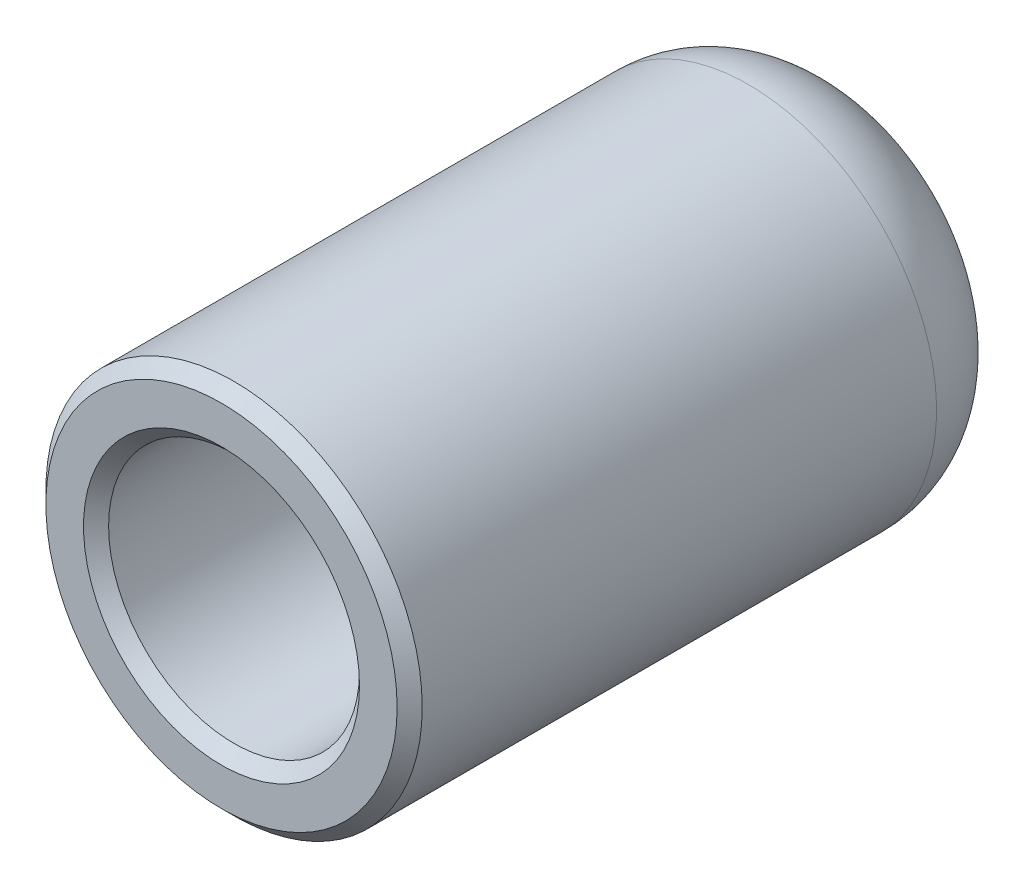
ISO-10303-21;
HEADER;
FILE_DESCRIPTION(('STEP AP214'),'2;1');
FILE_NAME('part.step','',(''),(''),'','','');
FILE_SCHEMA(('AUTOMOTIVE_DESIGN { 1 0 10303 214 1 1 1 1 }'));
ENDSEC;
DATA;
#1=APPLICATION_CONTEXT('core data for automotive mechanical design processes');
#2=APPLICATION_PROTOCOL_DEFINITION('international standard','automotive_design',2000,#1);
#3=PRODUCT_CONTEXT('',#1,'mechanical');
#4=PRODUCT('Part','Part','',(#3));
#5=PRODUCT_RELATED_PRODUCT_CATEGORY('part','',(#4));
#6=PRODUCT_DEFINITION_FORMATION('','',#4);
#7=PRODUCT_DEFINITION_CONTEXT('part definition',#1,'design');
#8=PRODUCT_DEFINITION('design','',#6,#7);
#9=PRODUCT_DEFINITION_SHAPE('','',#8);
#10=(LENGTH_UNIT() NAMED_UNIT(*) SI_UNIT(.MILLI.,.METRE.));
#11=(NAMED_UNIT(*) PLANE_ANGLE_UNIT() SI_UNIT($,.RADIAN.));
#12=(NAMED_UNIT(*) SI_UNIT($,.STERADIAN.) SOLID_ANGLE_UNIT());
#13=UNCERTAINTY_MEASURE_WITH_UNIT(LENGTH_MEASURE(1.E-05),#10,'distance_accuracy_value','');
#14=(GEOMETRIC_REPRESENTATION_CONTEXT(3) GLOBAL_UNCERTAINTY_ASSIGNED_CONTEXT((#13)) GLOBAL_UNIT_ASSIGNED_CONTEXT((#10,
#11,#12)) REPRESENTATION_CONTEXT('',''));
#15=CARTESIAN_POINT('',(0.,0.,0.));
#16=DIRECTION('',(0.,0.,1.));
#17=DIRECTION('',(1.,0.,0.));
#18=AXIS2_PLACEMENT_3D('',#15,#16,#17);
#19=CARTESIAN_POINT('',(0.,0.,25.));
#20=DIRECTION('',(0.,0.,-1.));
#21=DIRECTION('',(-1.,0.,0.));
#22=AXIS2_PLACEMENT_3D('',#19,#20,#21);
#23=CYLINDRICAL_SURFACE('',#22,2.5);
#24=CARTESIAN_POINT('',(0.,0.,13.));
#25=DIRECTION('',(0.,0.,1.));
#26=DIRECTION('',(1.,0.,0.));
#27=AXIS2_PLACEMENT_3D('',#24,#25,#26);
#28=CIRCLE('',#27,2.5);
#29=CARTESIAN_POINT('',(2.5,0.,13.));
#30=VERTEX_POINT('',#29);
#31=EDGE_CURVE('E263',#30,#30,#28,.F.);
#32=ORIENTED_EDGE('',*,*,#31,.F.);
#33=EDGE_LOOP('',(#32));
#34=FACE_BOUND('',#33,.T.);
#35=CARTESIAN_POINT('',(0.,0.,10.));
#36=DIRECTION('',(0.,0.,-1.));
#37=DIRECTION('',(-1.,0.,0.));
#38=AXIS2_PLACEMENT_3D('',#35,#36,#37);
#39=CIRCLE('',#38,2.5);
#40=CARTESIAN_POINT('',(-2.5,0.,10.));
#41=VERTEX_POINT('',#40);
#42=EDGE_CURVE('E38',#41,#41,#39,.F.);
#43=ORIENTED_EDGE('',*,*,#42,.F.);
#44=EDGE_LOOP('',(#43));
#45=FACE_BOUND('',#44,.T.);
#46=ADVANCED_FACE('F33',(#34,#45),#23,.F.);
#47=CARTESIAN_POINT('',(0.,0.,25.));
#48=DIRECTION('',(0.,0.,-1.));
#49=DIRECTION('',(-1.,0.,0.));
#50=AXIS2_PLACEMENT_3D('',#47,#48,#49);
#51=CYLINDRICAL_SURFACE('',#50,7.5);
#52=CARTESIAN_POINT('',(0.,0.,4.));
#53=DIRECTION('',(0.,0.,1.));
#54=DIRECTION('',(1.,0.,0.));
#55=AXIS2_PLACEMENT_3D('',#52,#53,#54);
#56=CIRCLE('',#55,7.5);
#57=CARTESIAN_POINT('',(2.09601180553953,-7.20116202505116,4.));
#58=VERTEX_POINT('',#57);
#59=CARTESIAN_POINT('',(-2.09601180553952,-7.20116202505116,4.));
#60=VERTEX_POINT('',#59);
#61=EDGE_CURVE('E243',#58,#60,#56,.T.);
#62=ORIENTED_EDGE('',*,*,#61,.T.);
#63=CARTESIAN_POINT('',(0.,0.,-3.22916358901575));
#64=DIRECTION('',(0.,0.708477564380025,0.705733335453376));
#65=DIRECTION('',(0.,0.705733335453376,-0.708477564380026));
#66=AXIS2_PLACEMENT_3D('',#63,#64,#65);
#67=ELLIPSE('',#66,10.627243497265,7.5);
#68=EDGE_CURVE('E58',#60,#58,#67,.T.);
#69=ORIENTED_EDGE('',*,*,#68,.T.);
#70=EDGE_LOOP('',(#62,#69));
#71=FACE_BOUND('',#70,.T.);
#72=CARTESIAN_POINT('',(0.,0.,24.5));
#73=DIRECTION('',(0.,0.,1.));
#74=DIRECTION('',(1.,0.,0.));
#75=AXIS2_PLACEMENT_3D('',#72,#73,#74);
#76=CIRCLE('',#75,7.5);
#77=CARTESIAN_POINT('',(7.5,0.,24.5));
#78=VERTEX_POINT('',#77);
#79=EDGE_CURVE('E277',#78,#78,#76,.F.);
#80=ORIENTED_EDGE('',*,*,#79,.T.);
#81=EDGE_LOOP('',(#80));
#82=FACE_BOUND('',#81,.T.);
#83=ADVANCED_FACE('F258',(#71,#82),#51,.T.);
#84=CARTESIAN_POINT('',(0.,0.,25.));
#85=DIRECTION('',(0.,0.,1.));
#86=DIRECTION('',(1.,0.,0.));
#87=AXIS2_PLACEMENT_3D('',#84,#85,#86);
#88=PLANE('',#87);
#89=CARTESIAN_POINT('',(0.,0.,25.));
#90=DIRECTION('',(0.,0.,1.));
#91=DIRECTION('',(1.,0.,0.));
#92=AXIS2_PLACEMENT_3D('',#89,#90,#91);
#93=CIRCLE('',#92,5.50000000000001);
#94=CARTESIAN_POINT('',(5.50000000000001,0.,25.));
#95=VERTEX_POINT('',#94);
#96=EDGE_CURVE('E275',#95,#95,#93,.F.);
#97=ORIENTED_EDGE('',*,*,#96,.T.);
#98=EDGE_LOOP('',(#97));
#99=FACE_BOUND('',#98,.T.);
#100=CARTESIAN_POINT('',(0.,0.,25.));
#101=DIRECTION('',(0.,0.,1.));
#102=DIRECTION('',(1.,0.,0.));
#103=AXIS2_PLACEMENT_3D('',#100,#101,#102);
#104=CIRCLE('',#103,7.00000000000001);
#105=CARTESIAN_POINT('',(7.00000000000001,0.,25.));
#106=VERTEX_POINT('',#105);
#107=EDGE_CURVE('E272',#106,#106,#104,.T.);
#108=ORIENTED_EDGE('',*,*,#107,.T.);
#109=EDGE_LOOP('',(#108));
#110=FACE_BOUND('',#109,.T.);
#111=ADVANCED_FACE('F287',(#99,#110),#88,.T.);
#112=CARTESIAN_POINT('',(0.,0.,13.));
#113=DIRECTION('',(0.,0.,1.));
#114=DIRECTION('',(1.,0.,0.));
#115=AXIS2_PLACEMENT_3D('',#112,#113,#114);
#116=PLANE('',#115);
#117=CARTESIAN_POINT('',(0.,0.,13.));
#118=DIRECTION('',(0.,0.,1.));
#119=DIRECTION('',(1.,0.,0.));
#120=AXIS2_PLACEMENT_3D('',#117,#118,#119);
#121=CIRCLE('',#120,5.);
#122=CARTESIAN_POINT('',(5.,0.,13.));
#123=VERTEX_POINT('',#122);
#124=EDGE_CURVE('E260',#123,#123,#121,.T.);
#125=ORIENTED_EDGE('',*,*,#124,.T.);
#126=EDGE_LOOP('',(#125));
#127=FACE_BOUND('',#126,.T.);
#128=ORIENTED_EDGE('',*,*,#31,.T.);
#129=EDGE_LOOP('',(#128));
#130=FACE_BOUND('',#129,.T.);
#131=ADVANCED_FACE('F232',(#127,#130),#116,.T.);
#132=CARTESIAN_POINT('',(0.,0.,13.));
#133=DIRECTION('',(0.,0.,1.));
#134=DIRECTION('',(1.,0.,0.));
#135=AXIS2_PLACEMENT_3D('',#132,#133,#134);
#136=CYLINDRICAL_SURFACE('',#135,5.);
#137=CARTESIAN_POINT('',(0.,0.,24.5));
#138=DIRECTION('',(0.,0.,1.));
#139=DIRECTION('',(1.,0.,0.));
#140=AXIS2_PLACEMENT_3D('',#137,#138,#139);
#141=CIRCLE('',#140,5.);
#142=CARTESIAN_POINT('',(5.,0.,24.5));
#143=VERTEX_POINT('',#142);
#144=EDGE_CURVE('E269',#143,#143,#141,.T.);
#145=ORIENTED_EDGE('',*,*,#144,.T.);
#146=EDGE_LOOP('',(#145));
#147=FACE_BOUND('',#146,.T.);
#148=ORIENTED_EDGE('',*,*,#124,.F.);
#149=EDGE_LOOP('',(#148));
#150=FACE_BOUND('',#149,.T.);
#151=ADVANCED_FACE('F295',(#147,#150),#136,.F.);
#152=CARTESIAN_POINT('',(0.,0.,24.5));
#153=DIRECTION('',(0.,0.,1.));
#154=DIRECTION('',(1.,0.,0.));
#155=AXIS2_PLACEMENT_3D('',#152,#153,#154);
#156=CONICAL_SURFACE('',#155,5.,0.785398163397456);
#157=ORIENTED_EDGE('',*,*,#96,.F.);
#158=EDGE_LOOP('',(#157));
#159=FACE_BOUND('',#158,.T.);
#160=ORIENTED_EDGE('',*,*,#144,.F.);
#161=EDGE_LOOP('',(#160));
#162=FACE_BOUND('',#161,.T.);
#163=ADVANCED_FACE('F284',(#159,#162),#156,.F.);
#164=CARTESIAN_POINT('',(0.,0.,25.));
#165=DIRECTION('',(0.,0.,-1.));
#166=DIRECTION('',(-1.,0.,0.));
#167=AXIS2_PLACEMENT_3D('',#164,#165,#166);
#168=CONICAL_SURFACE('',#167,7.00000000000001,0.785398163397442);
#169=ORIENTED_EDGE('',*,*,#79,.F.);
#170=EDGE_LOOP('',(#169));
#171=FACE_BOUND('',#170,.T.);
#172=ORIENTED_EDGE('',*,*,#107,.F.);
#173=EDGE_LOOP('',(#172));
#174=FACE_BOUND('',#173,.T.);
#175=ADVANCED_FACE('F281',(#171,#174),#168,.T.);
#176=CARTESIAN_POINT('',(0.,0.,4.));
#177=DIRECTION('',(0.,0.,1.));
#178=DIRECTION('',(1.,0.,0.));
#179=AXIS2_PLACEMENT_3D('',#176,#177,#178);
#180=DEGENERATE_TOROIDAL_SURFACE('',#179,3.5,4.,.T.);
#181=CARTESIAN_POINT('',(-1.44954746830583,-3.5002,0.0104162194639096));
#182=CARTESIAN_POINT('',(-1.5349754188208,-3.41477204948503,0.00710153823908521));
#183=CARTESIAN_POINT('',(-1.620416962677,-3.32933050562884,0.00489692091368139));
#184=CARTESIAN_POINT('',(-1.79130751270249,-3.15843995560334,0.00191822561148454));
#185=CARTESIAN_POINT('',(-1.87675651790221,-3.07299095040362,0.00114404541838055));
#186=CARTESIAN_POINT('',(-2.04764924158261,-2.90209822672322,0.000236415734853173));
#187=CARTESIAN_POINT('',(-2.13309296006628,-2.81665450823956,0.00010292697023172));
#188=CARTESIAN_POINT('',(-2.303982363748,-2.64576510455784,-1.52824222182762E-05));
#189=CARTESIAN_POINT('',(-2.38942804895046,-2.56031941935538,0.));
#190=CARTESIAN_POINT('',(-2.56031941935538,-2.38942804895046,0.));
#191=CARTESIAN_POINT('',(-2.64576510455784,-2.303982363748,-1.52824222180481E-05));
#192=CARTESIAN_POINT('',(-2.81665450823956,-2.13309296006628,0.00010292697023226));
#193=CARTESIAN_POINT('',(-2.90209822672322,-2.04764924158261,0.000236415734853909));
#194=CARTESIAN_POINT('',(-3.07299095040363,-1.87675651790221,0.00114404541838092));
#195=CARTESIAN_POINT('',(-3.15843995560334,-1.79130751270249,0.00191822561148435));
#196=CARTESIAN_POINT('',(-3.32933050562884,-1.620416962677,0.00489692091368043));
#197=CARTESIAN_POINT('',(-3.41477204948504,-1.5349754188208,0.00710153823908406));
#198=CARTESIAN_POINT('',(-3.5002,-1.44954746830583,0.010416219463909));
#199=B_SPLINE_CURVE_WITH_KNOTS('',3,(#181,#182,#183,#184,#185,#186,#187,#188,#189,#190,#191,
#192,#193,#194,#195,#196,#197,#198),.UNSPECIFIED.,.F.,.F.,(4,2,2,2,2,2,2,2,4),(0.,
0.362555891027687,0.725085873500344,1.08759363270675,1.45010882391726,1.81262401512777,
2.17513177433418,2.53766175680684,2.90021764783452),.UNSPECIFIED.);
#200=CARTESIAN_POINT('',(-1.73009726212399,-3.21965020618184,0.00300615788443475));
#201=VERTEX_POINT('',#200);
#202=CARTESIAN_POINT('',(-3.5,-1.44974746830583,0.0104083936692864));
#203=VERTEX_POINT('',#202);
#204=EDGE_CURVE('E178',#201,#203,#199,.T.);
#205=ORIENTED_EDGE('',*,*,#204,.F.);
#206=CARTESIAN_POINT('',(-2.09532719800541,-7.2013612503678,4.0002));
#207=CARTESIAN_POINT('',(-2.33374103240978,-7.1320466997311,3.93061592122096));
#208=CARTESIAN_POINT('',(-2.56540797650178,-7.04983970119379,3.84808926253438));
#209=CARTESIAN_POINT('',(-3.00844611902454,-6.8596147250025,3.65712460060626));
#210=CARTESIAN_POINT('',(-3.21966814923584,-6.75142456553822,3.54851374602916));
#211=CARTESIAN_POINT('',(-3.57826279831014,-6.53065223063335,3.3268829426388));
#212=CARTESIAN_POINT('',(-3.73038700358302,-6.42193558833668,3.21774355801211));
#213=CARTESIAN_POINT('',(-4.00723791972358,-6.18861272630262,2.98351342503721));
#214=CARTESIAN_POINT('',(-4.13204015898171,-6.06405185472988,2.858468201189));
#215=CARTESIAN_POINT('',(-4.32705586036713,-5.82605391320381,2.61954480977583));
#216=CARTESIAN_POINT('',(-4.40313869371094,-5.71501456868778,2.50807369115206));
#217=CARTESIAN_POINT('',(-4.52873078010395,-5.48560760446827,2.27777468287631));
#218=CARTESIAN_POINT('',(-4.57825916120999,-5.36724532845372,2.15895215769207));
#219=CARTESIAN_POINT('',(-4.64030372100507,-5.14700748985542,1.93785792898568));
#220=CARTESIAN_POINT('',(-4.65774393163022,-5.04582620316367,1.83628320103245));
#221=CARTESIAN_POINT('',(-4.66883366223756,-4.84274270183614,1.63241001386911));
#222=CARTESIAN_POINT('',(-4.66248956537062,-4.74084068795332,1.53011175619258));
#223=CARTESIAN_POINT('',(-4.62377575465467,-4.53862752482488,1.32711229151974));
#224=CARTESIAN_POINT('',(-4.59120434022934,-4.43833487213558,1.22642965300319));
#225=CARTESIAN_POINT('',(-4.49879209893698,-4.24421152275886,1.0315514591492));
#226=CARTESIAN_POINT('',(-4.43898133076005,-4.15037383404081,0.937348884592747));
#227=CARTESIAN_POINT('',(-4.30318369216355,-3.9855113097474,0.771845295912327));
#228=CARTESIAN_POINT('',(-4.23051201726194,-3.91312030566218,0.699172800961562));
#229=CARTESIAN_POINT('',(-4.06792521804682,-3.77877355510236,0.564303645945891));
#230=CARTESIAN_POINT('',(-3.97801749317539,-3.7168133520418,0.502102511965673));
#231=CARTESIAN_POINT('',(-3.79023110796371,-3.6081990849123,0.393065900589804));
#232=CARTESIAN_POINT('',(-3.69314799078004,-3.56085239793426,0.345535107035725));
#233=CARTESIAN_POINT('',(-3.49010908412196,-3.47694683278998,0.261303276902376));
#234=CARTESIAN_POINT('',(-3.38415230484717,-3.44038916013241,0.22460345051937));
#235=CARTESIAN_POINT('',(-3.18851676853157,-3.38373088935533,0.16772486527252));
#236=CARTESIAN_POINT('',(-3.09987418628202,-3.36179760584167,0.145706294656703));
#237=CARTESIAN_POINT('',(-2.92012875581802,-3.32364289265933,0.107403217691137));
#238=CARTESIAN_POINT('',(-2.82902441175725,-3.30742502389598,0.0911222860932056));
#239=CARTESIAN_POINT('',(-2.55309076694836,-3.2660481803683,0.0495845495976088));
#240=CARTESIAN_POINT('',(-2.36606010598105,-3.24827711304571,0.0317443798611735));
#241=CARTESIAN_POINT('',(-2.07608527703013,-3.23051967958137,0.0139178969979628));
#242=CARTESIAN_POINT('',(-1.97349543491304,-3.22612235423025,0.00950347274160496));
#243=CARTESIAN_POINT('',(-1.76813182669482,-3.21999406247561,0.00335135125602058));
#244=CARTESIAN_POINT('',(-1.6653580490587,-3.21826326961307,0.00161382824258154));
#245=CARTESIAN_POINT('',(-1.4599734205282,-3.2165172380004,-0.000138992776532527));
#246=CARTESIAN_POINT('',(-1.35736258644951,-3.21649911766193,-0.000157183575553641));
#247=CARTESIAN_POINT('',(-1.15215237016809,-3.21736289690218,0.00070995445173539));
#248=CARTESIAN_POINT('',(-1.04955298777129,-3.21824477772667,0.00159526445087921));
#249=CARTESIAN_POINT('',(-0.844323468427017,-3.22025856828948,0.00361688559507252));
#250=CARTESIAN_POINT('',(-0.741693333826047,-3.22139056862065,0.0047532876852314));
#251=CARTESIAN_POINT('',(-0.536428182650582,-3.22342302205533,0.00679364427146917));
#252=CARTESIAN_POINT('',(-0.433793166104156,-3.22432347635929,0.00769759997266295));
#253=CARTESIAN_POINT('',(-0.228521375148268,-3.22559254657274,0.00897160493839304));
#254=CARTESIAN_POINT('',(-0.125884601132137,-3.2259611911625,0.00934168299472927));
#255=CARTESIAN_POINT('',(0.07938900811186,-3.22605585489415,0.00943671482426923));
#256=CARTESIAN_POINT('',(0.182025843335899,-3.22578187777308,0.00916167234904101));
#257=CARTESIAN_POINT('',(0.387447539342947,-3.22467229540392,0.00804777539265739));
#258=CARTESIAN_POINT('',(0.490232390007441,-3.22383584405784,0.00720807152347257));
#259=CARTESIAN_POINT('',(0.695798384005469,-3.22187382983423,0.00523842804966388));
#260=CARTESIAN_POINT('',(0.798579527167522,-3.22074825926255,0.00410848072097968));
#261=CARTESIAN_POINT('',(1.00414375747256,-3.2186651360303,0.00201725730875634));
#262=CARTESIAN_POINT('',(1.10692684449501,-3.21770757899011,0.00105597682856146));
#263=CARTESIAN_POINT('',(1.31249937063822,-3.21659006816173,-6.58794166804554E-05));
#264=CARTESIAN_POINT('',(1.41528880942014,-3.21643008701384,-0.000226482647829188));
#265=CARTESIAN_POINT('',(1.61983658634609,-3.2176913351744,0.00103966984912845));
#266=CARTESIAN_POINT('',(1.72159494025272,-3.21909674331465,0.0024505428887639));
#267=CARTESIAN_POINT('',(1.92497436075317,-3.22437080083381,0.0077451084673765));
#268=CARTESIAN_POINT('',(2.02659541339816,-3.22823968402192,0.0116290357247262));
#269=CARTESIAN_POINT('',(2.33060078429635,-3.24505754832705,0.0285122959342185));
#270=CARTESIAN_POINT('',(2.53263618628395,-3.2632109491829,0.0467362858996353));
#271=CARTESIAN_POINT('',(2.87856282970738,-3.31468927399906,0.0984147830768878));
#272=CARTESIAN_POINT('',(3.02392026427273,-3.34284574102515,0.12668073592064));
#273=CARTESIAN_POINT('',(3.30667491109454,-3.41502863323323,0.199144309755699));
#274=CARTESIAN_POINT('',(3.44408161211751,-3.45903566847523,0.243322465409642));
#275=CARTESIAN_POINT('',(3.67991800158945,-3.55461096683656,0.339269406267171));
#276=CARTESIAN_POINT('',(3.780792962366,-3.60315398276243,0.388001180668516));
#277=CARTESIAN_POINT('',(3.96956627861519,-3.71153791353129,0.496806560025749));
#278=CARTESIAN_POINT('',(4.05747036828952,-3.77137380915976,0.556875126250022));
#279=CARTESIAN_POINT('',(4.21729648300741,-3.90113017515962,0.687136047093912));
#280=CARTESIAN_POINT('',(4.28918084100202,-3.97107378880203,0.757351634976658));
#281=CARTESIAN_POINT('',(4.41459460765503,-4.11873349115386,0.905585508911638));
#282=CARTESIAN_POINT('',(4.46811837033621,-4.19645196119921,0.983606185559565));
#283=CARTESIAN_POINT('',(4.55456824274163,-4.35453969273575,1.14230863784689));
#284=CARTESIAN_POINT('',(4.58808958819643,-4.43474854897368,1.22282938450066));
#285=CARTESIAN_POINT('',(4.63736461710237,-4.59780556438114,1.38652044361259));
#286=CARTESIAN_POINT('',(4.65311568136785,-4.68065411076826,1.46969114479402));
#287=CARTESIAN_POINT('',(4.66842528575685,-4.85499898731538,1.64471395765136));
#288=CARTESIAN_POINT('',(4.66629722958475,-4.94656686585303,1.73663789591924));
#289=CARTESIAN_POINT('',(4.6434415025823,-5.12851480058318,1.91929333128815));
#290=CARTESIAN_POINT('',(4.6227044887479,-5.21889423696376,2.01002420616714));
#291=CARTESIAN_POINT('',(4.55978347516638,-5.41125078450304,2.20312872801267));
#292=CARTESIAN_POINT('',(4.5146827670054,-5.51275089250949,2.30502351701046));
#293=CARTESIAN_POINT('',(4.40482382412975,-5.71027131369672,2.50331199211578));
#294=CARTESIAN_POINT('',(4.34005486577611,-5.80628860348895,2.59970264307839));
#295=CARTESIAN_POINT('',(4.17972353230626,-6.009183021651,2.80338601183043));
#296=CARTESIAN_POINT('',(4.08065376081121,-6.11467857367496,2.90929178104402));
#297=CARTESIAN_POINT('',(3.86271649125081,-6.31492028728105,3.11031213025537));
#298=CARTESIAN_POINT('',(3.74383463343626,-6.40965856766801,3.20541879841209));
#299=CARTESIAN_POINT('',(3.46492373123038,-6.6051083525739,3.40162858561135));
#300=CARTESIAN_POINT('',(3.3014001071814,-6.70333247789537,3.50023465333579));
#301=CARTESIAN_POINT('',(2.9565159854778,-6.88259828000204,3.68019752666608));
#302=CARTESIAN_POINT('',(2.77515499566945,-6.96363948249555,3.76155385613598));
#303=CARTESIAN_POINT('',(2.50735864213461,-7.06668970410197,3.86500478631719));
#304=CARTESIAN_POINT('',(2.42629015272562,-7.0958519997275,3.8942804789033));
#305=CARTESIAN_POINT('',(2.26222985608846,-7.15097532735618,3.94961815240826));
#306=CARTESIAN_POINT('',(2.17924303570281,-7.17694374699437,3.97568754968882));
#307=CARTESIAN_POINT('',(2.09532719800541,-7.20136125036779,4.0002));
#308=B_SPLINE_CURVE_WITH_KNOTS('',3,(#206,#207,#208,#209,#210,#211,#212,#213,#214,#215,#216,
#217,#218,#219,#220,#221,#222,#223,#224,#225,#226,#227,#228,#229,#230,#231,#232,#233,#234,#235,
#236,#237,#238,#239,#240,#241,#242,#243,#244,#245,#246,#247,#248,#249,#250,#251,#252,#253,#254,
#255,#256,#257,#258,#259,#260,#261,#262,#263,#264,#265,#266,#267,#268,#269,#270,#271,#272,#273,
#274,#275,#276,#277,#278,#279,#280,#281,#282,#283,#284,#285,#286,#287,#288,#289,#290,#291,#292,
#293,#294,#295,#296,#297,#298,#299,#300,#301,#302,#303,#304,#305,#306,#307),.UNSPECIFIED.,.F.,
.F.,(4,2,2,2,2,2,2,2,2,2,2,2,2,2,2,2,2,2,2,2,2,2,2,2,2,2,2,2,2,2,2,2,2,2,2,2,2,2,2,2,2,2,2,2,2,
2,2,2,2,2,4),(0.,0.77400296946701,1.5532838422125,2.20023475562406,2.84537401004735,
3.36767703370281,3.88960331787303,4.32115082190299,4.75258251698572,5.18736418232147,
5.62166722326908,5.99678483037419,6.37174175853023,6.72432901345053,7.07695564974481,
7.35834007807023,7.6398995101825,8.20434600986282,8.51266828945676,8.82101063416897,
9.12883418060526,9.43665131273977,9.74458011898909,10.0525073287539,10.3604179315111,
10.6683267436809,10.9766997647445,11.285080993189,11.5934541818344,11.9018167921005,
12.2070908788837,12.5123939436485,13.121476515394,13.5722795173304,14.0225329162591,
14.3872389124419,14.7517831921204,15.1171757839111,15.4826806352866,15.8366822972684,
16.1907361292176,16.5785385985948,16.9665358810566,17.4170340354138,17.8677782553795,
18.4037884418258,18.9401888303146,19.5820443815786,20.2239176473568,20.4967893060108,
20.7690174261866),.UNSPECIFIED.);
#309=EDGE_CURVE('E242',#60,#201,#308,.T.);
#310=ORIENTED_EDGE('',*,*,#309,.F.);
#311=ORIENTED_EDGE('',*,*,#61,.F.);
#312=CARTESIAN_POINT('',(1.73009726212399,-3.21965020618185,0.00300615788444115));
#313=VERTEX_POINT('',#312);
#314=EDGE_CURVE('E235',#313,#58,#308,.T.);
#315=ORIENTED_EDGE('',*,*,#314,.F.);
#316=CARTESIAN_POINT('',(3.5002,-1.44954746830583,0.0104162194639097));
#317=CARTESIAN_POINT('',(3.41477204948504,-1.5349754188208,0.00710153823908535));
#318=CARTESIAN_POINT('',(3.32933050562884,-1.620416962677,0.00489692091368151));
#319=CARTESIAN_POINT('',(3.15843995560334,-1.79130751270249,0.00191822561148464));
#320=CARTESIAN_POINT('',(3.07299095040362,-1.87675651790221,0.00114404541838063));
#321=CARTESIAN_POINT('',(2.90209822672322,-2.04764924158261,0.000236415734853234));
#322=CARTESIAN_POINT('',(2.81665450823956,-2.13309296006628,0.000102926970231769));
#323=CARTESIAN_POINT('',(2.64576510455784,-2.303982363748,-1.52824222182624E-05));
#324=CARTESIAN_POINT('',(2.56031941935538,-2.38942804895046,0.));
#325=CARTESIAN_POINT('',(2.38942804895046,-2.56031941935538,0.));
#326=CARTESIAN_POINT('',(2.303982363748,-2.64576510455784,-1.52824222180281E-05));
#327=CARTESIAN_POINT('',(2.13309296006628,-2.81665450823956,0.000102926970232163));
#328=CARTESIAN_POINT('',(2.04764924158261,-2.90209822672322,0.000236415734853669));
#329=CARTESIAN_POINT('',(1.87675651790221,-3.07299095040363,0.00114404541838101));
#330=CARTESIAN_POINT('',(1.79130751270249,-3.15843995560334,0.00191822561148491));
#331=CARTESIAN_POINT('',(1.620416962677,-3.32933050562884,0.00489692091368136));
#332=CARTESIAN_POINT('',(1.5349754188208,-3.41477204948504,0.00710153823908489));
#333=CARTESIAN_POINT('',(1.44954746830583,-3.5002,0.0104162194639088));
#334=B_SPLINE_CURVE_WITH_KNOTS('',3,(#316,#317,#318,#319,#320,#321,#322,#323,#324,#325,#326,
#327,#328,#329,#330,#331,#332,#333),.UNSPECIFIED.,.F.,.F.,(4,2,2,2,2,2,2,2,4),(0.,
0.362555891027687,0.725085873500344,1.08759363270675,1.45010882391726,1.81262401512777,
2.17513177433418,2.53766175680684,2.90021764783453),.UNSPECIFIED.);
#335=CARTESIAN_POINT('',(3.5,-1.44974746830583,0.0104083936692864));
#336=VERTEX_POINT('',#335);
#337=EDGE_CURVE('E50',#336,#313,#334,.T.);
#338=ORIENTED_EDGE('',*,*,#337,.F.);
#339=CARTESIAN_POINT('',(3.5,6.39029876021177,2.70920935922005));
#340=CARTESIAN_POINT('',(3.5,6.35128127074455,2.60879098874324));
#341=CARTESIAN_POINT('',(3.5,6.30775177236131,2.5101453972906));
#342=CARTESIAN_POINT('',(3.5,6.212194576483,2.31710830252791));
#343=CARTESIAN_POINT('',(3.5,6.16017041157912,2.22271505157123));
#344=CARTESIAN_POINT('',(3.5,6.04821939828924,2.03897564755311));
#345=CARTESIAN_POINT('',(3.5,5.98830724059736,1.94962054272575));
#346=CARTESIAN_POINT('',(3.5,5.86111738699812,1.77634318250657));
#347=CARTESIAN_POINT('',(3.5,5.79383921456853,1.69242127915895));
#348=CARTESIAN_POINT('',(3.5,5.58216856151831,1.44988062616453));
#349=CARTESIAN_POINT('',(3.5,5.42761758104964,1.2999633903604));
#350=CARTESIAN_POINT('',(3.5,5.09717346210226,1.02644213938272));
#351=CARTESIAN_POINT('',(3.5,4.92129753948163,0.902817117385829));
#352=CARTESIAN_POINT('',(3.5,4.6391863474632,0.733703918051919));
#353=CARTESIAN_POINT('',(3.5,4.53856366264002,0.678599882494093));
#354=CARTESIAN_POINT('',(3.5,4.33347291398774,0.575939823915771));
#355=CARTESIAN_POINT('',(3.5,4.22900326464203,0.52838695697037));
#356=CARTESIAN_POINT('',(3.5,4.01683490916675,0.440587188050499));
#357=CARTESIAN_POINT('',(3.5,3.90913074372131,0.400353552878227));
#358=CARTESIAN_POINT('',(3.5,3.69150252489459,0.326990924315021));
#359=CARTESIAN_POINT('',(3.5,3.58158141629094,0.293853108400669));
#360=CARTESIAN_POINT('',(3.5,3.25245817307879,0.205219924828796));
#361=CARTESIAN_POINT('',(3.5,3.03065862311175,0.159209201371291));
#362=CARTESIAN_POINT('',(3.5,2.69556139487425,0.10581578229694));
#363=CARTESIAN_POINT('',(3.5,2.58336702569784,0.0906155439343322));
#364=CARTESIAN_POINT('',(3.5,2.35846454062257,0.064682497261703));
#365=CARTESIAN_POINT('',(3.5,2.2457564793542,0.0539492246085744));
#366=CARTESIAN_POINT('',(3.5,1.90570927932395,0.0271577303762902));
#367=CARTESIAN_POINT('',(3.5,1.67794316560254,0.0167247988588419));
#368=CARTESIAN_POINT('',(3.5,1.33615937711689,0.0072642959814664));
#369=CARTESIAN_POINT('',(3.5,1.22218095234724,0.00514251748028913));
#370=CARTESIAN_POINT('',(3.5,0.994206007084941,0.0021926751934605));
#371=CARTESIAN_POINT('',(3.5,0.880209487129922,0.00136457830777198));
#372=CARTESIAN_POINT('',(3.5,0.650927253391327,0.000347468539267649));
#373=CARTESIAN_POINT('',(3.5,0.535641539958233,0.000165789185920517));
#374=CARTESIAN_POINT('',(3.5,0.305094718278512,-7.60906238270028E-06));
#375=CARTESIAN_POINT('',(3.5,0.189833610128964,6.30772271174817E-07));
#376=CARTESIAN_POINT('',(3.5,-0.0407231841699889,-4.73191175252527E-07));
#377=CARTESIAN_POINT('',(3.5,-0.156018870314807,-9.82226738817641E-06));
#378=CARTESIAN_POINT('',(3.5,-0.386609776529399,3.73857210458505E-05));
#379=CARTESIAN_POINT('',(3.5,-0.501904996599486,9.39427296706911E-05));
#380=CARTESIAN_POINT('',(3.5,-0.732045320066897,0.000634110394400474));
#381=CARTESIAN_POINT('',(3.5,-0.84689041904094,0.00111604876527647));
#382=CARTESIAN_POINT('',(3.5,-1.07657085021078,0.00309240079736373));
#383=CARTESIAN_POINT('',(3.5,-1.19140618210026,0.00458683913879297));
#384=CARTESIAN_POINT('',(3.5,-1.53579308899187,0.0116941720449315));
#385=CARTESIAN_POINT('',(3.5,-1.765329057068,0.019930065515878));
#386=CARTESIAN_POINT('',(3.5,-2.1344492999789,0.0442911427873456));
#387=CARTESIAN_POINT('',(3.5,-2.27430288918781,0.0561030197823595));
#388=CARTESIAN_POINT('',(3.5,-2.55335093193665,0.0864122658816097));
#389=CARTESIAN_POINT('',(3.5,-2.69254517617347,0.104911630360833));
#390=CARTESIAN_POINT('',(3.5,-2.9687503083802,0.149843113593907));
#391=CARTESIAN_POINT('',(3.5,-3.10576949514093,0.176223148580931));
#392=CARTESIAN_POINT('',(3.5,-3.37775293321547,0.238140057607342));
#393=CARTESIAN_POINT('',(3.5,-3.51271716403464,0.273677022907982));
#394=CARTESIAN_POINT('',(3.5,-3.78160787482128,0.355473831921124));
#395=CARTESIAN_POINT('',(3.5,-3.91548821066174,0.401886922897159));
#396=CARTESIAN_POINT('',(3.5,-4.17888360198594,0.505862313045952));
#397=CARTESIAN_POINT('',(3.5,-4.30839853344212,0.563424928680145));
#398=CARTESIAN_POINT('',(3.5,-4.56198338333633,0.690286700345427));
#399=CARTESIAN_POINT('',(3.5,-4.68603874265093,0.759615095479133));
#400=CARTESIAN_POINT('',(3.5,-4.92681246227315,0.910014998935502));
#401=CARTESIAN_POINT('',(3.5,-5.04353292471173,0.991083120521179));
#402=CARTESIAN_POINT('',(3.5,-5.24216881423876,1.14470754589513));
#403=CARTESIAN_POINT('',(3.5,-5.32590559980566,1.21491893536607));
#404=CARTESIAN_POINT('',(3.5,-5.48738020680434,1.36192256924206));
#405=CARTESIAN_POINT('',(3.5,-5.56511911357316,1.43871361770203));
#406=CARTESIAN_POINT('',(3.5,-5.71371119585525,1.59834278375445));
#407=CARTESIAN_POINT('',(3.5,-5.78458100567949,1.68116539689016));
#408=CARTESIAN_POINT('',(3.5,-5.9189592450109,1.85254352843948));
#409=CARTESIAN_POINT('',(3.5,-5.98246981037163,1.94109737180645));
#410=CARTESIAN_POINT('',(3.5,-6.11145741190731,2.13864427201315));
#411=CARTESIAN_POINT('',(3.5,-6.1754952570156,2.24858273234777));
#412=CARTESIAN_POINT('',(3.5,-6.29189912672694,2.47458888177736));
#413=CARTESIAN_POINT('',(3.5,-6.34425505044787,2.59066176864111));
#414=CARTESIAN_POINT('',(3.5,-6.39029876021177,2.70920935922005));
#415=B_SPLINE_CURVE_WITH_KNOTS('',3,(#339,#340,#341,#342,#343,#344,#345,#346,#347,#348,#349,
#350,#351,#352,#353,#354,#355,#356,#357,#358,#359,#360,#361,#362,#363,#364,#365,#366,#367,#368,
#369,#370,#371,#372,#373,#374,#375,#376,#377,#378,#379,#380,#381,#382,#383,#384,#385,#386,#387,
#388,#389,#390,#391,#392,#393,#394,#395,#396,#397,#398,#399,#400,#401,#402,#403,#404,#405,#406,
#407,#408,#409,#410,#411,#412,#413,#414),.UNSPECIFIED.,.F.,.F.,(4,2,2,2,2,2,2,2,2,2,2,2,2,2,2,2,
2,2,2,2,2,2,2,2,2,2,2,2,2,2,2,2,2,2,2,2,2,4),(0.,0.323060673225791,0.645987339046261,
0.968320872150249,1.29067526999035,1.93356296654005,2.57593506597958,2.91983192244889,
3.26387213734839,3.60852987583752,3.95275656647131,4.63081826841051,4.97042246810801,
5.30999135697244,5.99365334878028,6.33565267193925,6.67764324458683,7.02350150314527,
7.36928460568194,7.71517148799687,8.061058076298,8.40559092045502,8.75013216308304,
9.43890421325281,9.85983503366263,10.2808915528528,10.6992246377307,11.1175618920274,
11.5421915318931,11.9668332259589,12.3925460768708,12.8181363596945,13.1456322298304,
13.4730686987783,13.7996913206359,14.1262189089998,14.50721456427,14.8885383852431),.UNSPECIFIED.);
#416=CARTESIAN_POINT('',(3.5,1.44974746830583,0.0104083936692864));
#417=VERTEX_POINT('',#416);
#418=EDGE_CURVE('E201',#417,#336,#415,.T.);
#419=ORIENTED_EDGE('',*,*,#418,.F.);
#420=CARTESIAN_POINT('',(1.44954746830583,3.5002,0.010416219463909));
#421=CARTESIAN_POINT('',(1.5349754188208,3.41477204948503,0.00710153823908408));
#422=CARTESIAN_POINT('',(1.620416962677,3.32933050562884,0.00489692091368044));
#423=CARTESIAN_POINT('',(1.79130751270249,3.15843995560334,0.00191822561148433));
#424=CARTESIAN_POINT('',(1.87675651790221,3.07299095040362,0.00114404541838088));
#425=CARTESIAN_POINT('',(2.04764924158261,2.90209822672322,0.000236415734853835));
#426=CARTESIAN_POINT('',(2.13309296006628,2.81665450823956,0.000102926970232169));
#427=CARTESIAN_POINT('',(2.303982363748,2.64576510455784,-1.52824222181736E-05));
#428=CARTESIAN_POINT('',(2.38942804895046,2.56031941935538,0.));
#429=CARTESIAN_POINT('',(2.56031941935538,2.38942804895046,0.));
#430=CARTESIAN_POINT('',(2.64576510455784,2.303982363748,-1.52824222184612E-05));
#431=CARTESIAN_POINT('',(2.81665450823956,2.13309296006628,0.000102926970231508));
#432=CARTESIAN_POINT('',(2.90209822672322,2.04764924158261,0.000236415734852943));
#433=CARTESIAN_POINT('',(3.07299095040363,1.87675651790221,0.00114404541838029));
#434=CARTESIAN_POINT('',(3.15843995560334,1.79130751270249,0.00191822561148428));
#435=CARTESIAN_POINT('',(3.32933050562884,1.620416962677,0.0048969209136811));
#436=CARTESIAN_POINT('',(3.41477204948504,1.5349754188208,0.00710153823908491));
#437=CARTESIAN_POINT('',(3.5002,1.44954746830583,0.0104162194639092));
#438=B_SPLINE_CURVE_WITH_KNOTS('',3,(#420,#421,#422,#423,#424,#425,#426,#427,#428,#429,#430,
#431,#432,#433,#434,#435,#436,#437),.UNSPECIFIED.,.F.,.F.,(4,2,2,2,2,2,2,2,4),(0.,
0.362555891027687,0.725085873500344,1.08759363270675,1.45010882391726,1.81262401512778,
2.17513177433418,2.53766175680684,2.90021764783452),.UNSPECIFIED.);
#439=CARTESIAN_POINT('',(1.44974746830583,3.5,0.0104083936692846));
#440=VERTEX_POINT('',#439);
#441=EDGE_CURVE('E208',#440,#417,#438,.T.);
#442=ORIENTED_EDGE('',*,*,#441,.F.);
#443=CARTESIAN_POINT('',(-6.39029876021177,3.5,2.70920935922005));
#444=CARTESIAN_POINT('',(-6.35128127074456,3.5,2.60879098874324));
#445=CARTESIAN_POINT('',(-6.30775177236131,3.5,2.5101453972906));
#446=CARTESIAN_POINT('',(-6.212194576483,3.5,2.31710830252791));
#447=CARTESIAN_POINT('',(-6.16017041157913,3.5,2.22271505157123));
#448=CARTESIAN_POINT('',(-6.04821939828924,3.5,2.03897564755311));
#449=CARTESIAN_POINT('',(-5.98830724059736,3.5,1.94962054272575));
#450=CARTESIAN_POINT('',(-5.86111738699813,3.5,1.77634318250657));
#451=CARTESIAN_POINT('',(-5.79383921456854,3.5,1.69242127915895));
#452=CARTESIAN_POINT('',(-5.58216856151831,3.5,1.44988062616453));
#453=CARTESIAN_POINT('',(-5.42761758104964,3.5,1.2999633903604));
#454=CARTESIAN_POINT('',(-5.09717346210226,3.5,1.02644213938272));
#455=CARTESIAN_POINT('',(-4.92129753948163,3.5,0.902817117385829));
#456=CARTESIAN_POINT('',(-4.6391863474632,3.5,0.73370391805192));
#457=CARTESIAN_POINT('',(-4.53856366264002,3.5,0.678599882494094));
#458=CARTESIAN_POINT('',(-4.33347291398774,3.5,0.575939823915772));
#459=CARTESIAN_POINT('',(-4.22900326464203,3.5,0.528386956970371));
#460=CARTESIAN_POINT('',(-4.01683490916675,3.5,0.440587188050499));
#461=CARTESIAN_POINT('',(-3.90913074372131,3.5,0.400353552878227));
#462=CARTESIAN_POINT('',(-3.69150252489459,3.5,0.326990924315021));
#463=CARTESIAN_POINT('',(-3.58158141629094,3.5,0.293853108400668));
#464=CARTESIAN_POINT('',(-3.25245817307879,3.5,0.205219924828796));
#465=CARTESIAN_POINT('',(-3.03065862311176,3.5,0.159209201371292));
#466=CARTESIAN_POINT('',(-2.69556139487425,3.5,0.10581578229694));
#467=CARTESIAN_POINT('',(-2.58336702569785,3.5,0.0906155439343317));
#468=CARTESIAN_POINT('',(-2.35846454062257,3.5,0.0646824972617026));
#469=CARTESIAN_POINT('',(-2.2457564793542,3.5,0.0539492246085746));
#470=CARTESIAN_POINT('',(-1.90570927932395,3.5,0.0271577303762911));
#471=CARTESIAN_POINT('',(-1.67794316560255,3.5,0.0167247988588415));
#472=CARTESIAN_POINT('',(-1.3361593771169,3.5,0.00726429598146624));
#473=CARTESIAN_POINT('',(-1.22218095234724,3.5,0.00514251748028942));
#474=CARTESIAN_POINT('',(-0.994206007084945,3.5,0.0021926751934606));
#475=CARTESIAN_POINT('',(-0.880209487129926,3.5,0.00136457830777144));
#476=CARTESIAN_POINT('',(-0.650927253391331,3.5,0.000347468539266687));
#477=CARTESIAN_POINT('',(-0.535641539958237,3.5,0.000165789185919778));
#478=CARTESIAN_POINT('',(-0.305094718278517,3.5,-7.60906238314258E-06));
#479=CARTESIAN_POINT('',(-0.189833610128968,3.5,6.30772270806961E-07));
#480=CARTESIAN_POINT('',(0.0407231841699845,3.5,-4.73191175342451E-07));
#481=CARTESIAN_POINT('',(0.156018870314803,3.5,-9.82226738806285E-06));
#482=CARTESIAN_POINT('',(0.386609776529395,3.5,3.73857210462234E-05));
#483=CARTESIAN_POINT('',(0.501904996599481,3.5,9.39427296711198E-05));
#484=CARTESIAN_POINT('',(0.732045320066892,3.5,0.000634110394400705));
#485=CARTESIAN_POINT('',(0.846890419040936,3.5,0.00111604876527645));
#486=CARTESIAN_POINT('',(1.07657085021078,3.5,0.00309240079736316));
#487=CARTESIAN_POINT('',(1.19140618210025,3.5,0.0045868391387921));
#488=CARTESIAN_POINT('',(1.53579308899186,3.5,0.0116941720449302));
#489=CARTESIAN_POINT('',(1.76532905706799,3.5,0.0199300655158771));
#490=CARTESIAN_POINT('',(2.1344492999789,3.5,0.0442911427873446));
#491=CARTESIAN_POINT('',(2.2743028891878,3.5,0.0561030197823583));
#492=CARTESIAN_POINT('',(2.55335093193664,3.5,0.0864122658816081));
#493=CARTESIAN_POINT('',(2.69254517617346,3.5,0.104911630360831));
#494=CARTESIAN_POINT('',(2.96875030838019,3.5,0.149843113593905));
#495=CARTESIAN_POINT('',(3.10576949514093,3.5,0.176223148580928));
#496=CARTESIAN_POINT('',(3.37775293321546,3.5,0.238140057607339));
#497=CARTESIAN_POINT('',(3.51271716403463,3.5,0.273677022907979));
#498=CARTESIAN_POINT('',(3.78160787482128,3.5,0.355473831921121));
#499=CARTESIAN_POINT('',(3.91548821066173,3.5,0.401886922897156));
#500=CARTESIAN_POINT('',(4.17888360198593,3.5,0.50586231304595));
#501=CARTESIAN_POINT('',(4.30839853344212,3.5,0.563424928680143));
#502=CARTESIAN_POINT('',(4.56198338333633,3.5,0.690286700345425));
#503=CARTESIAN_POINT('',(4.68603874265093,3.5,0.759615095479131));
#504=CARTESIAN_POINT('',(4.92681246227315,3.5,0.910014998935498));
#505=CARTESIAN_POINT('',(5.04353292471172,3.5,0.991083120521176));
#506=CARTESIAN_POINT('',(5.24216881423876,3.5,1.14470754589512));
#507=CARTESIAN_POINT('',(5.32590559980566,3.5,1.21491893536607));
#508=CARTESIAN_POINT('',(5.48738020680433,3.5,1.36192256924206));
#509=CARTESIAN_POINT('',(5.56511911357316,3.5,1.43871361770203));
#510=CARTESIAN_POINT('',(5.71371119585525,3.5,1.59834278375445));
#511=CARTESIAN_POINT('',(5.78458100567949,3.5,1.68116539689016));
#512=CARTESIAN_POINT('',(5.9189592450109,3.5,1.85254352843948));
#513=CARTESIAN_POINT('',(5.98246981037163,3.5,1.94109737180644));
#514=CARTESIAN_POINT('',(6.11145741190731,3.5,2.13864427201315));
#515=CARTESIAN_POINT('',(6.1754952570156,3.5,2.24858273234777));
#516=CARTESIAN_POINT('',(6.29189912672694,3.5,2.47458888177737));
#517=CARTESIAN_POINT('',(6.34425505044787,3.5,2.59066176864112));
#518=CARTESIAN_POINT('',(6.39029876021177,3.5,2.70920935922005));
#519=B_SPLINE_CURVE_WITH_KNOTS('',3,(#443,#444,#445,#446,#447,#448,#449,#450,#451,#452,#453,
#454,#455,#456,#457,#458,#459,#460,#461,#462,#463,#464,#465,#466,#467,#468,#469,#470,#471,#472,
#473,#474,#475,#476,#477,#478,#479,#480,#481,#482,#483,#484,#485,#486,#487,#488,#489,#490,#491,
#492,#493,#494,#495,#496,#497,#498,#499,#500,#501,#502,#503,#504,#505,#506,#507,#508,#509,#510,
#511,#512,#513,#514,#515,#516,#517,#518),.UNSPECIFIED.,.F.,.F.,(4,2,2,2,2,2,2,2,2,2,2,2,2,2,2,2,
2,2,2,2,2,2,2,2,2,2,2,2,2,2,2,2,2,2,2,2,2,4),(0.,0.323060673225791,0.645987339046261,
0.968320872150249,1.29067526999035,1.93356296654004,2.57593506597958,2.91983192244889,
3.26387213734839,3.60852987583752,3.95275656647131,4.63081826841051,4.97042246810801,
5.30999135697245,5.99365334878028,6.33565267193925,6.67764324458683,7.02350150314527,
7.36928460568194,7.71517148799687,8.061058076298,8.40559092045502,8.75013216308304,
9.43890421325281,9.85983503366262,10.2808915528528,10.6992246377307,11.1175618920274,
11.5421915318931,11.9668332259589,12.3925460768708,12.8181363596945,13.1456322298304,
13.4730686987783,13.7996913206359,14.1262189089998,14.50721456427,14.8885383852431),.UNSPECIFIED.);
#520=CARTESIAN_POINT('',(-1.44974746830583,3.5,0.0104083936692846));
#521=VERTEX_POINT('',#520);
#522=EDGE_CURVE('E122',#521,#440,#519,.T.);
#523=ORIENTED_EDGE('',*,*,#522,.F.);
#524=CARTESIAN_POINT('',(-3.5002,1.44954746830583,0.010416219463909));
#525=CARTESIAN_POINT('',(-3.41477204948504,1.5349754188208,0.00710153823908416));
#526=CARTESIAN_POINT('',(-3.32933050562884,1.62041696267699,0.00489692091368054));
#527=CARTESIAN_POINT('',(-3.15843995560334,1.79130751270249,0.00191822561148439));
#528=CARTESIAN_POINT('',(-3.07299095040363,1.87675651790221,0.00114404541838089));
#529=CARTESIAN_POINT('',(-2.90209822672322,2.04764924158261,0.000236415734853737));
#530=CARTESIAN_POINT('',(-2.81665450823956,2.13309296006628,0.000102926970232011));
#531=CARTESIAN_POINT('',(-2.64576510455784,2.303982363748,-1.52824222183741E-05));
#532=CARTESIAN_POINT('',(-2.56031941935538,2.38942804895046,0.));
#533=CARTESIAN_POINT('',(-2.38942804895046,2.56031941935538,0.));
#534=CARTESIAN_POINT('',(-2.303982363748,2.64576510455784,-1.52824222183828E-05));
#535=CARTESIAN_POINT('',(-2.13309296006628,2.81665450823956,0.000102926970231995));
#536=CARTESIAN_POINT('',(-2.04764924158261,2.90209822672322,0.00023641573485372));
#537=CARTESIAN_POINT('',(-1.87675651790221,3.07299095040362,0.00114404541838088));
#538=CARTESIAN_POINT('',(-1.79130751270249,3.15843995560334,0.00191822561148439));
#539=CARTESIAN_POINT('',(-1.620416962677,3.32933050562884,0.00489692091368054));
#540=CARTESIAN_POINT('',(-1.5349754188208,3.41477204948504,0.00710153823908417));
#541=CARTESIAN_POINT('',(-1.44954746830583,3.5002,0.010416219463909));
#542=B_SPLINE_CURVE_WITH_KNOTS('',3,(#524,#525,#526,#527,#528,#529,#530,#531,#532,#533,#534,
#535,#536,#537,#538,#539,#540,#541),.UNSPECIFIED.,.F.,.F.,(4,2,2,2,2,2,2,2,4),(0.,
0.362555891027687,0.725085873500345,1.08759363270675,1.45010882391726,1.81262401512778,
2.17513177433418,2.53766175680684,2.90021764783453),.UNSPECIFIED.);
#543=CARTESIAN_POINT('',(-3.5,1.44974746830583,0.0104083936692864));
#544=VERTEX_POINT('',#543);
#545=EDGE_CURVE('E43',#544,#521,#542,.T.);
#546=ORIENTED_EDGE('',*,*,#545,.F.);
#547=CARTESIAN_POINT('',(-3.5,-6.39029876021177,2.70920935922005));
#548=CARTESIAN_POINT('',(-3.5,-6.35128127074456,2.60879098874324));
#549=CARTESIAN_POINT('',(-3.5,-6.30775177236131,2.5101453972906));
#550=CARTESIAN_POINT('',(-3.5,-6.212194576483,2.31710830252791));
#551=CARTESIAN_POINT('',(-3.5,-6.16017041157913,2.22271505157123));
#552=CARTESIAN_POINT('',(-3.5,-6.04821939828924,2.03897564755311));
#553=CARTESIAN_POINT('',(-3.5,-5.98830724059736,1.94962054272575));
#554=CARTESIAN_POINT('',(-3.5,-5.86111738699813,1.77634318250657));
#555=CARTESIAN_POINT('',(-3.5,-5.79383921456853,1.69242127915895));
#556=CARTESIAN_POINT('',(-3.5,-5.58216856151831,1.44988062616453));
#557=CARTESIAN_POINT('',(-3.5,-5.42761758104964,1.2999633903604));
#558=CARTESIAN_POINT('',(-3.5,-5.09717346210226,1.02644213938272));
#559=CARTESIAN_POINT('',(-3.5,-4.92129753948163,0.902817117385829));
#560=CARTESIAN_POINT('',(-3.5,-4.6391863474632,0.733703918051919));
#561=CARTESIAN_POINT('',(-3.5,-4.53856366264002,0.678599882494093));
#562=CARTESIAN_POINT('',(-3.5,-4.33347291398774,0.575939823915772));
#563=CARTESIAN_POINT('',(-3.5,-4.22900326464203,0.528386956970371));
#564=CARTESIAN_POINT('',(-3.5,-4.01683490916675,0.440587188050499));
#565=CARTESIAN_POINT('',(-3.5,-3.90913074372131,0.400353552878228));
#566=CARTESIAN_POINT('',(-3.5,-3.69150252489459,0.326990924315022));
#567=CARTESIAN_POINT('',(-3.5,-3.58158141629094,0.293853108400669));
#568=CARTESIAN_POINT('',(-3.5,-3.25245817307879,0.205219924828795));
#569=CARTESIAN_POINT('',(-3.5,-3.03065862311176,0.159209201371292));
#570=CARTESIAN_POINT('',(-3.5,-2.69556139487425,0.10581578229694));
#571=CARTESIAN_POINT('',(-3.5,-2.58336702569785,0.0906155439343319));
#572=CARTESIAN_POINT('',(-3.5,-2.35846454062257,0.0646824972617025));
#573=CARTESIAN_POINT('',(-3.5,-2.2457564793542,0.0539492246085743));
#574=CARTESIAN_POINT('',(-3.5,-1.90570927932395,0.027157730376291));
#575=CARTESIAN_POINT('',(-3.5,-1.67794316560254,0.0167247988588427));
#576=CARTESIAN_POINT('',(-3.5,-1.3361593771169,0.00726429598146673));
#577=CARTESIAN_POINT('',(-3.5,-1.22218095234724,0.00514251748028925));
#578=CARTESIAN_POINT('',(-3.5,-0.994206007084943,0.00219267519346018));
#579=CARTESIAN_POINT('',(-3.5,-0.880209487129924,0.00136457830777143));
#580=CARTESIAN_POINT('',(-3.5,-0.65092725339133,0.000347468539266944));
#581=CARTESIAN_POINT('',(-3.5,-0.535641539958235,0.000165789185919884));
#582=CARTESIAN_POINT('',(-3.5,-0.305094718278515,-7.60906238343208E-06));
#583=CARTESIAN_POINT('',(-3.5,-0.189833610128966,6.30772270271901E-07));
#584=CARTESIAN_POINT('',(-3.5,0.0407231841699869,-4.73191175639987E-07));
#585=CARTESIAN_POINT('',(-3.5,0.156018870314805,-9.82226738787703E-06));
#586=CARTESIAN_POINT('',(-3.5,0.386609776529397,3.73857210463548E-05));
#587=CARTESIAN_POINT('',(-3.5,0.501904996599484,9.39427296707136E-05));
#588=CARTESIAN_POINT('',(-3.5,0.732045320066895,0.000634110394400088));
#589=CARTESIAN_POINT('',(-3.5,0.846890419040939,0.00111604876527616));
#590=CARTESIAN_POINT('',(-3.5,1.07657085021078,0.00309240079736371));
#591=CARTESIAN_POINT('',(-3.5,1.19140618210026,0.00458683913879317));
#592=CARTESIAN_POINT('',(-3.5,1.53579308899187,0.0116941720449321));
#593=CARTESIAN_POINT('',(-3.5,1.765329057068,0.0199300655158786));
#594=CARTESIAN_POINT('',(-3.5,2.1344492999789,0.0442911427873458));
#595=CARTESIAN_POINT('',(-3.5,2.27430288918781,0.0561030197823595));
#596=CARTESIAN_POINT('',(-3.5,2.55335093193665,0.086412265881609));
#597=CARTESIAN_POINT('',(-3.5,2.69254517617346,0.104911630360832));
#598=CARTESIAN_POINT('',(-3.5,2.96875030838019,0.149843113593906));
#599=CARTESIAN_POINT('',(-3.5,3.10576949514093,0.17622314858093));
#600=CARTESIAN_POINT('',(-3.5,3.37775293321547,0.238140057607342));
#601=CARTESIAN_POINT('',(-3.5,3.51271716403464,0.273677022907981));
#602=CARTESIAN_POINT('',(-3.5,3.78160787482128,0.355473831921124));
#603=CARTESIAN_POINT('',(-3.5,3.91548821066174,0.401886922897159));
#604=CARTESIAN_POINT('',(-3.5,4.17888360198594,0.505862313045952));
#605=CARTESIAN_POINT('',(-3.5,4.30839853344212,0.563424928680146));
#606=CARTESIAN_POINT('',(-3.5,4.56198338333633,0.690286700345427));
#607=CARTESIAN_POINT('',(-3.5,4.68603874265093,0.759615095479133));
#608=CARTESIAN_POINT('',(-3.5,4.92681246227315,0.910014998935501));
#609=CARTESIAN_POINT('',(-3.5,5.04353292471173,0.991083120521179));
#610=CARTESIAN_POINT('',(-3.5,5.24216881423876,1.14470754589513));
#611=CARTESIAN_POINT('',(-3.5,5.32590559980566,1.21491893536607));
#612=CARTESIAN_POINT('',(-3.5,5.48738020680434,1.36192256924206));
#613=CARTESIAN_POINT('',(-3.5,5.56511911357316,1.43871361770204));
#614=CARTESIAN_POINT('',(-3.5,5.71371119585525,1.59834278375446));
#615=CARTESIAN_POINT('',(-3.5,5.78458100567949,1.68116539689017));
#616=CARTESIAN_POINT('',(-3.5,5.9189592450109,1.85254352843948));
#617=CARTESIAN_POINT('',(-3.5,5.98246981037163,1.94109737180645));
#618=CARTESIAN_POINT('',(-3.5,6.11145741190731,2.13864427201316));
#619=CARTESIAN_POINT('',(-3.5,6.17549525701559,2.24858273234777));
#620=CARTESIAN_POINT('',(-3.5,6.29189912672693,2.47458888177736));
#621=CARTESIAN_POINT('',(-3.5,6.34425505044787,2.59066176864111));
#622=CARTESIAN_POINT('',(-3.5,6.39029876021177,2.70920935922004));
#623=B_SPLINE_CURVE_WITH_KNOTS('',3,(#547,#548,#549,#550,#551,#552,#553,#554,#555,#556,#557,
#558,#559,#560,#561,#562,#563,#564,#565,#566,#567,#568,#569,#570,#571,#572,#573,#574,#575,#576,
#577,#578,#579,#580,#581,#582,#583,#584,#585,#586,#587,#588,#589,#590,#591,#592,#593,#594,#595,
#596,#597,#598,#599,#600,#601,#602,#603,#604,#605,#606,#607,#608,#609,#610,#611,#612,#613,#614,
#615,#616,#617,#618,#619,#620,#621,#622),.UNSPECIFIED.,.F.,.F.,(4,2,2,2,2,2,2,2,2,2,2,2,2,2,2,2,
2,2,2,2,2,2,2,2,2,2,2,2,2,2,2,2,2,2,2,2,2,4),(0.,0.32306067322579,0.64598733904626,
0.968320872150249,1.29067526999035,1.93356296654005,2.57593506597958,2.91983192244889,
3.26387213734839,3.60852987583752,3.95275656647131,4.63081826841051,4.97042246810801,
5.30999135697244,5.99365334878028,6.33565267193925,6.67764324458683,7.02350150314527,
7.36928460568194,7.71517148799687,8.061058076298,8.40559092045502,8.75013216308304,
9.43890421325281,9.85983503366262,10.2808915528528,10.6992246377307,11.1175618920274,
11.5421915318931,11.9668332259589,12.3925460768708,12.8181363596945,13.1456322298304,
13.4730686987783,13.7996913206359,14.1262189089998,14.50721456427,14.8885383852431),.UNSPECIFIED.);
#624=EDGE_CURVE('E11',#203,#544,#623,.T.);
#625=ORIENTED_EDGE('',*,*,#624,.F.);
#626=EDGE_LOOP('',(#205,#310,#311,#315,#338,#419,#442,#523,#546,#625));
#627=FACE_BOUND('',#626,.T.);
#628=ADVANCED_FACE('F35',(#627),#180,.T.);
#629=CARTESIAN_POINT('',(-7.5,-7.5,4.3));
#630=DIRECTION('',(0.,0.708477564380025,0.705733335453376));
#631=DIRECTION('',(0.,-0.705733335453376,0.708477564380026));
#632=AXIS2_PLACEMENT_3D('',#629,#630,#631);
#633=PLANE('',#632);
#634=ORIENTED_EDGE('',*,*,#309,.T.);
#635=DIRECTION('',(0.576601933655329,-0.576601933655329,0.578844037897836));
#636=VECTOR('',#635,1.);
#637=CARTESIAN_POINT('',(-0.791152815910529,-4.1585946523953,0.945601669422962));
#638=LINE('',#637,#636);
#639=CARTESIAN_POINT('',(-1.44974746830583,-3.5,0.284446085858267));
#640=VERTEX_POINT('',#639);
#641=EDGE_CURVE('E249',#201,#640,#638,.T.);
#642=ORIENTED_EDGE('',*,*,#641,.T.);
#643=DIRECTION('',(1.,0.,0.));
#644=VECTOR('',#643,1.);
#645=CARTESIAN_POINT('',(-7.5,-3.5,0.284446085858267));
#646=LINE('',#645,#644);
#647=CARTESIAN_POINT('',(1.44974746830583,-3.5,0.284446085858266));
#648=VERTEX_POINT('',#647);
#649=EDGE_CURVE('E247',#640,#648,#646,.T.);
#650=ORIENTED_EDGE('',*,*,#649,.T.);
#651=DIRECTION('',(0.576601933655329,0.576601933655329,-0.578844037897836));
#652=VECTOR('',#651,1.);
#653=CARTESIAN_POINT('',(-4.19589403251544,-9.14564150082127,5.95204054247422));
#654=LINE('',#653,#652);
#655=EDGE_CURVE('E245',#648,#313,#654,.T.);
#656=ORIENTED_EDGE('',*,*,#655,.T.);
#657=ORIENTED_EDGE('',*,*,#314,.T.);
#658=ORIENTED_EDGE('',*,*,#68,.F.);
#659=EDGE_LOOP('',(#634,#642,#650,#656,#657,#658));
#660=FACE_BOUND('',#659,.T.);
#661=ADVANCED_FACE('F228',(#660),#633,.F.);
#662=CARTESIAN_POINT('',(0.,0.,10.));
#663=DIRECTION('',(0.,0.,-1.));
#664=DIRECTION('',(-1.,0.,0.));
#665=AXIS2_PLACEMENT_3D('',#662,#663,#664);
#666=PLANE('',#665);
#667=DIRECTION('',(1.,0.,0.));
#668=VECTOR('',#667,1.);
#669=CARTESIAN_POINT('',(-1.44974746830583,3.5,10.));
#670=LINE('',#669,#668);
#671=CARTESIAN_POINT('',(-1.44974746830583,3.5,10.));
#672=VERTEX_POINT('',#671);
#673=CARTESIAN_POINT('',(1.44974746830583,3.5,10.));
#674=VERTEX_POINT('',#673);
#675=EDGE_CURVE('E120',#672,#674,#670,.T.);
#676=ORIENTED_EDGE('',*,*,#675,.T.);
#677=DIRECTION('',(0.707106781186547,-0.707106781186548,0.));
#678=VECTOR('',#677,1.);
#679=CARTESIAN_POINT('',(1.44974746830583,3.5,10.));
#680=LINE('',#679,#678);
#681=CARTESIAN_POINT('',(3.5,1.44974746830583,10.));
#682=VERTEX_POINT('',#681);
#683=EDGE_CURVE('E128',#674,#682,#680,.T.);
#684=ORIENTED_EDGE('',*,*,#683,.T.);
#685=DIRECTION('',(0.,-1.,0.));
#686=VECTOR('',#685,1.);
#687=CARTESIAN_POINT('',(3.5,1.44974746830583,10.));
#688=LINE('',#687,#686);
#689=CARTESIAN_POINT('',(3.5,-1.44974746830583,10.));
#690=VERTEX_POINT('',#689);
#691=EDGE_CURVE('E134',#682,#690,#688,.T.);
#692=ORIENTED_EDGE('',*,*,#691,.T.);
#693=DIRECTION('',(-0.707106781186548,-0.707106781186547,0.));
#694=VECTOR('',#693,1.);
#695=CARTESIAN_POINT('',(3.5,-1.44974746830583,10.));
#696=LINE('',#695,#694);
#697=CARTESIAN_POINT('',(1.44974746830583,-3.5,10.));
#698=VERTEX_POINT('',#697);
#699=EDGE_CURVE('E143',#690,#698,#696,.T.);
#700=ORIENTED_EDGE('',*,*,#699,.T.);
#701=DIRECTION('',(-1.,0.,0.));
#702=VECTOR('',#701,1.);
#703=CARTESIAN_POINT('',(1.44974746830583,-3.5,10.));
#704=LINE('',#703,#702);
#705=CARTESIAN_POINT('',(-1.44974746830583,-3.5,10.));
#706=VERTEX_POINT('',#705);
#707=EDGE_CURVE('E146',#698,#706,#704,.T.);
#708=ORIENTED_EDGE('',*,*,#707,.T.);
#709=DIRECTION('',(-0.707106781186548,0.707106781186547,0.));
#710=VECTOR('',#709,1.);
#711=CARTESIAN_POINT('',(-1.44974746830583,-3.5,10.));
#712=LINE('',#711,#710);
#713=CARTESIAN_POINT('',(-3.5,-1.44974746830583,10.));
#714=VERTEX_POINT('',#713);
#715=EDGE_CURVE('E149',#706,#714,#712,.T.);
#716=ORIENTED_EDGE('',*,*,#715,.T.);
#717=DIRECTION('',(0.,1.,0.));
#718=VECTOR('',#717,1.);
#719=CARTESIAN_POINT('',(-3.5,-1.44974746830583,10.));
#720=LINE('',#719,#718);
#721=CARTESIAN_POINT('',(-3.5,1.44974746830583,10.));
#722=VERTEX_POINT('',#721);
#723=EDGE_CURVE('E152',#714,#722,#720,.T.);
#724=ORIENTED_EDGE('',*,*,#723,.T.);
#725=DIRECTION('',(0.707106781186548,0.707106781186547,0.));
#726=VECTOR('',#725,1.);
#727=CARTESIAN_POINT('',(-3.5,1.44974746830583,10.));
#728=LINE('',#727,#726);
#729=EDGE_CURVE('E125',#722,#672,#728,.T.);
#730=ORIENTED_EDGE('',*,*,#729,.T.);
#731=EDGE_LOOP('',(#676,#684,#692,#700,#708,#716,#724,#730));
#732=FACE_BOUND('',#731,.T.);
#733=ORIENTED_EDGE('',*,*,#42,.T.);
#734=EDGE_LOOP('',(#733));
#735=FACE_BOUND('',#734,.T.);
#736=ADVANCED_FACE('F136',(#732,#735),#666,.T.);
#737=CARTESIAN_POINT('',(1.44974746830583,-3.5,10.));
#738=DIRECTION('',(0.,-1.,0.));
#739=DIRECTION('',(1.,0.,0.));
#740=AXIS2_PLACEMENT_3D('',#737,#738,#739);
#741=PLANE('',#740);
#742=DIRECTION('',(0.,0.,-1.));
#743=VECTOR('',#742,1.);
#744=CARTESIAN_POINT('',(-1.44974746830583,-3.5,10.));
#745=LINE('',#744,#743);
#746=EDGE_CURVE('E163',#706,#640,#745,.T.);
#747=ORIENTED_EDGE('',*,*,#746,.F.);
#748=ORIENTED_EDGE('',*,*,#707,.F.);
#749=DIRECTION('',(0.,0.,-1.));
#750=VECTOR('',#749,1.);
#751=CARTESIAN_POINT('',(1.44974746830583,-3.5,10.));
#752=LINE('',#751,#750);
#753=EDGE_CURVE('E166',#698,#648,#752,.T.);
#754=ORIENTED_EDGE('',*,*,#753,.T.);
#755=ORIENTED_EDGE('',*,*,#649,.F.);
#756=EDGE_LOOP('',(#747,#748,#754,#755));
#757=FACE_BOUND('',#756,.T.);
#758=ADVANCED_FACE('F193',(#757),#741,.F.);
#759=CARTESIAN_POINT('',(-1.44974746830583,3.5,10.));
#760=DIRECTION('',(0.,1.,0.));
#761=DIRECTION('',(-1.,0.,0.));
#762=AXIS2_PLACEMENT_3D('',#759,#760,#761);
#763=PLANE('',#762);
#764=DIRECTION('',(0.,0.,-1.));
#765=VECTOR('',#764,1.);
#766=CARTESIAN_POINT('',(-1.44974746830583,3.5,10.));
#767=LINE('',#766,#765);
#768=EDGE_CURVE('E155',#672,#521,#767,.T.);
#769=ORIENTED_EDGE('',*,*,#768,.T.);
#770=ORIENTED_EDGE('',*,*,#522,.T.);
#771=DIRECTION('',(0.,0.,-1.));
#772=VECTOR('',#771,1.);
#773=CARTESIAN_POINT('',(1.44974746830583,3.5,10.));
#774=LINE('',#773,#772);
#775=EDGE_CURVE('E115',#674,#440,#774,.T.);
#776=ORIENTED_EDGE('',*,*,#775,.F.);
#777=ORIENTED_EDGE('',*,*,#675,.F.);
#778=EDGE_LOOP('',(#769,#770,#776,#777));
#779=FACE_BOUND('',#778,.T.);
#780=ADVANCED_FACE('F118',(#779),#763,.F.);
#781=CARTESIAN_POINT('',(-3.5,1.44974746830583,10.));
#782=DIRECTION('',(-0.707106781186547,0.707106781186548,0.));
#783=DIRECTION('',(-0.707106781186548,-0.707106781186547,0.));
#784=AXIS2_PLACEMENT_3D('',#781,#782,#783);
#785=PLANE('',#784);
#786=DIRECTION('',(0.,0.,-1.));
#787=VECTOR('',#786,1.);
#788=CARTESIAN_POINT('',(-3.5,1.44974746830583,10.));
#789=LINE('',#788,#787);
#790=EDGE_CURVE('E157',#722,#544,#789,.T.);
#791=ORIENTED_EDGE('',*,*,#790,.T.);
#792=ORIENTED_EDGE('',*,*,#545,.T.);
#793=ORIENTED_EDGE('',*,*,#768,.F.);
#794=ORIENTED_EDGE('',*,*,#729,.F.);
#795=EDGE_LOOP('',(#791,#792,#793,#794));
#796=FACE_BOUND('',#795,.T.);
#797=ADVANCED_FACE('F227',(#796),#785,.F.);
#798=CARTESIAN_POINT('',(-3.5,-1.44974746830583,10.));
#799=DIRECTION('',(-1.,0.,0.));
#800=DIRECTION('',(0.,0.,1.));
#801=AXIS2_PLACEMENT_3D('',#798,#799,#800);
#802=PLANE('',#801);
#803=DIRECTION('',(0.,0.,-1.));
#804=VECTOR('',#803,1.);
#805=CARTESIAN_POINT('',(-3.5,-1.44974746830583,10.));
#806=LINE('',#805,#804);
#807=EDGE_CURVE('E160',#714,#203,#806,.T.);
#808=ORIENTED_EDGE('',*,*,#807,.T.);
#809=ORIENTED_EDGE('',*,*,#624,.T.);
#810=ORIENTED_EDGE('',*,*,#790,.F.);
#811=ORIENTED_EDGE('',*,*,#723,.F.);
#812=EDGE_LOOP('',(#808,#809,#810,#811));
#813=FACE_BOUND('',#812,.T.);
#814=ADVANCED_FACE('F356',(#813),#802,.F.);
#815=CARTESIAN_POINT('',(-1.44974746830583,-3.5,10.));
#816=DIRECTION('',(-0.707106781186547,-0.707106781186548,0.));
#817=DIRECTION('',(0.707106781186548,-0.707106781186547,0.));
#818=AXIS2_PLACEMENT_3D('',#815,#816,#817);
#819=PLANE('',#818);
#820=ORIENTED_EDGE('',*,*,#204,.T.);
#821=ORIENTED_EDGE('',*,*,#807,.F.);
#822=ORIENTED_EDGE('',*,*,#715,.F.);
#823=ORIENTED_EDGE('',*,*,#746,.T.);
#824=ORIENTED_EDGE('',*,*,#641,.F.);
#825=EDGE_LOOP('',(#820,#821,#822,#823,#824));
#826=FACE_BOUND('',#825,.T.);
#827=ADVANCED_FACE('F192',(#826),#819,.F.);
#828=CARTESIAN_POINT('',(3.5,-1.44974746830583,10.));
#829=DIRECTION('',(0.707106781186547,-0.707106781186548,0.));
#830=DIRECTION('',(0.707106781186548,0.707106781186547,0.));
#831=AXIS2_PLACEMENT_3D('',#828,#829,#830);
#832=PLANE('',#831);
#833=ORIENTED_EDGE('',*,*,#337,.T.);
#834=ORIENTED_EDGE('',*,*,#655,.F.);
#835=ORIENTED_EDGE('',*,*,#753,.F.);
#836=ORIENTED_EDGE('',*,*,#699,.F.);
#837=DIRECTION('',(0.,0.,-1.));
#838=VECTOR('',#837,1.);
#839=CARTESIAN_POINT('',(3.5,-1.44974746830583,10.));
#840=LINE('',#839,#838);
#841=EDGE_CURVE('E169',#690,#336,#840,.T.);
#842=ORIENTED_EDGE('',*,*,#841,.T.);
#843=EDGE_LOOP('',(#833,#834,#835,#836,#842));
#844=FACE_BOUND('',#843,.T.);
#845=ADVANCED_FACE('F186',(#844),#832,.F.);
#846=CARTESIAN_POINT('',(3.5,1.44974746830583,10.));
#847=DIRECTION('',(1.,0.,0.));
#848=DIRECTION('',(0.,1.,0.));
#849=AXIS2_PLACEMENT_3D('',#846,#847,#848);
#850=PLANE('',#849);
#851=ORIENTED_EDGE('',*,*,#418,.T.);
#852=ORIENTED_EDGE('',*,*,#841,.F.);
#853=ORIENTED_EDGE('',*,*,#691,.F.);
#854=DIRECTION('',(0.,0.,-1.));
#855=VECTOR('',#854,1.);
#856=CARTESIAN_POINT('',(3.5,1.44974746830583,10.));
#857=LINE('',#856,#855);
#858=EDGE_CURVE('E124',#682,#417,#857,.T.);
#859=ORIENTED_EDGE('',*,*,#858,.T.);
#860=EDGE_LOOP('',(#851,#852,#853,#859));
#861=FACE_BOUND('',#860,.T.);
#862=ADVANCED_FACE('F191',(#861),#850,.F.);
#863=CARTESIAN_POINT('',(1.44974746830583,3.5,10.));
#864=DIRECTION('',(0.707106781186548,0.707106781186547,0.));
#865=DIRECTION('',(-0.707106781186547,0.707106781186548,0.));
#866=AXIS2_PLACEMENT_3D('',#863,#864,#865);
#867=PLANE('',#866);
#868=ORIENTED_EDGE('',*,*,#775,.T.);
#869=ORIENTED_EDGE('',*,*,#441,.T.);
#870=ORIENTED_EDGE('',*,*,#858,.F.);
#871=ORIENTED_EDGE('',*,*,#683,.F.);
#872=EDGE_LOOP('',(#868,#869,#870,#871));
#873=FACE_BOUND('',#872,.T.);
#874=ADVANCED_FACE('F129',(#873),#867,.F.);
#875=CLOSED_SHELL('',(#46,#83,#111,#131,#151,#163,#175,#628,#661,#736,#758,#780,#797,#814,#827,
#845,#862,#874));
#876=MANIFOLD_SOLID_BREP('B2',#875);
#877=ADVANCED_BREP_SHAPE_REPRESENTATION('',(#18,#876),#14);
#878=SHAPE_DEFINITION_REPRESENTATION(#9,#877);
ENDSEC;
END-ISO-10303-21;
